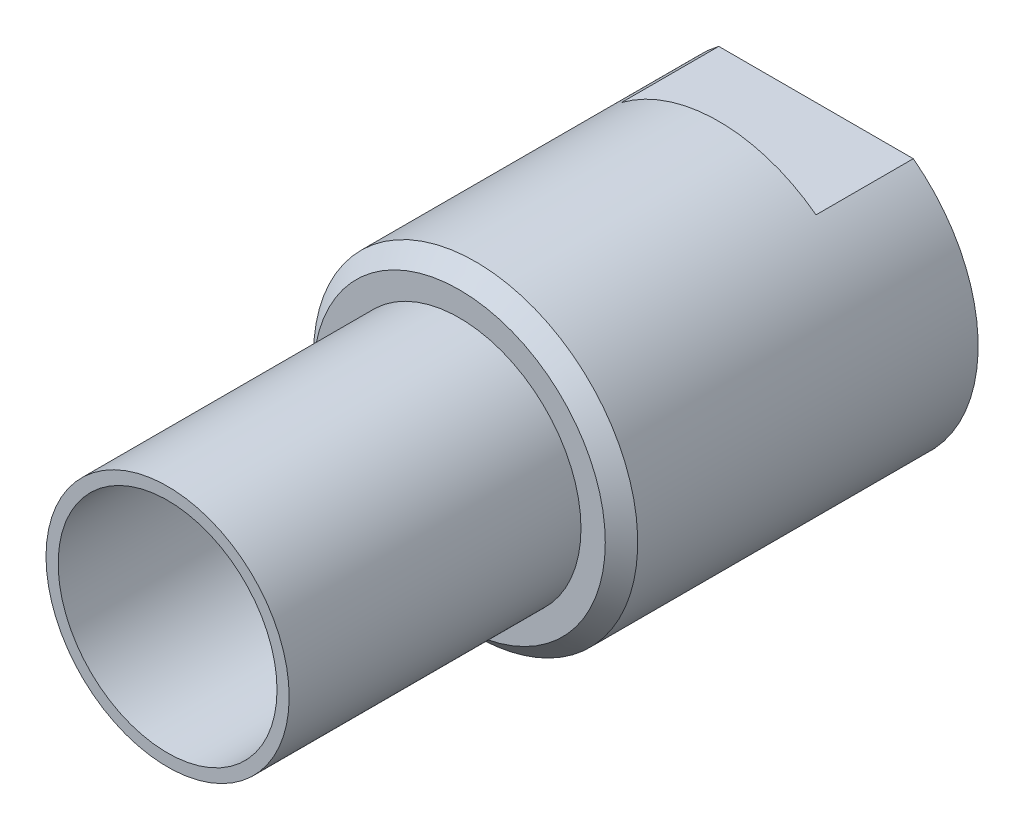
from build123d import *

# Parameters (mm, degrees)
ESQUISSE1_R             = 7.5
BOSS_EXTRU_1_DEPTH      = 18
ESQUISSE2_R             = 10
BOSS_EXTRU_2_DEPTH      = 22
ESQUISSE3_R             = 4
ENL_V_MAT_EXTRU_1_DEPTH = 41
CHANFREIN1_SIZE         = 1
ESQUISSE7_R             = 6.75
ENL_V_MAT_EXTRU_7_DEPTH = 10
ESQUISSE8_W             = 24.921628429
ESQUISSE8_H             = 2.229640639
ESQUISSE8_W_2           = 22.799873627
ESQUISSE8_H_2           = 3.272537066
ENL_V_MAT_EXTRU_8_DEPTH = 6


with BuildPart() as part:
    # Esquisse1 → Boss.-Extru.1 (new body)
    with BuildSketch(Plane.XY):
        Circle(ESQUISSE1_R)
    extrude(amount=BOSS_EXTRU_1_DEPTH)

    # Esquisse2 → Boss.-Extru.2 (add)
    with BuildSketch(Plane(origin=(0, 0, 0), x_dir=(-1, 0, 0), z_dir=(0, 0, -1))):
        Circle(ESQUISSE2_R)
    extrude(amount=BOSS_EXTRU_2_DEPTH)

    # Esquisse3 → Enl_v. mat.-Extru.1 (cut)
    with BuildSketch(Plane(origin=(0, 0, -22), x_dir=(-1, 0, 0), z_dir=(0, 0, -1))):
        Circle(ESQUISSE3_R)
    extrude(amount=-ENL_V_MAT_EXTRU_1_DEPTH, mode=Mode.SUBTRACT)

    # Chanfrein1
    chanfrein1_edges = [part.edges().sort_by_distance(p)[0] for p in [
        (10, 0, 0),
    ]]
    chamfer(chanfrein1_edges, length=CHANFREIN1_SIZE)

    # Esquisse7 → Enl_v. mat.-Extru.7 (cut)
    with BuildSketch(Plane.XY.offset(18)):
        Circle(ESQUISSE7_R)
    extrude(amount=-ENL_V_MAT_EXTRU_7_DEPTH, mode=Mode.SUBTRACT)

    # Esquisse8 → Enl_v. mat.-Extru.8 (cut)
    with BuildSketch(Plane(origin=(0, 0, -22), x_dir=(-1, 0, 0), z_dir=(0, 0, -1))):
        with Locations((0.773181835, 9.11482032)):
            Rectangle(ESQUISSE8_W, ESQUISSE8_H)
        with Locations((-1.11482032, -9.636268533)):
            Rectangle(ESQUISSE8_W_2, ESQUISSE8_H_2)
    extrude(amount=-ENL_V_MAT_EXTRU_8_DEPTH, mode=Mode.SUBTRACT)


solid = part.part
